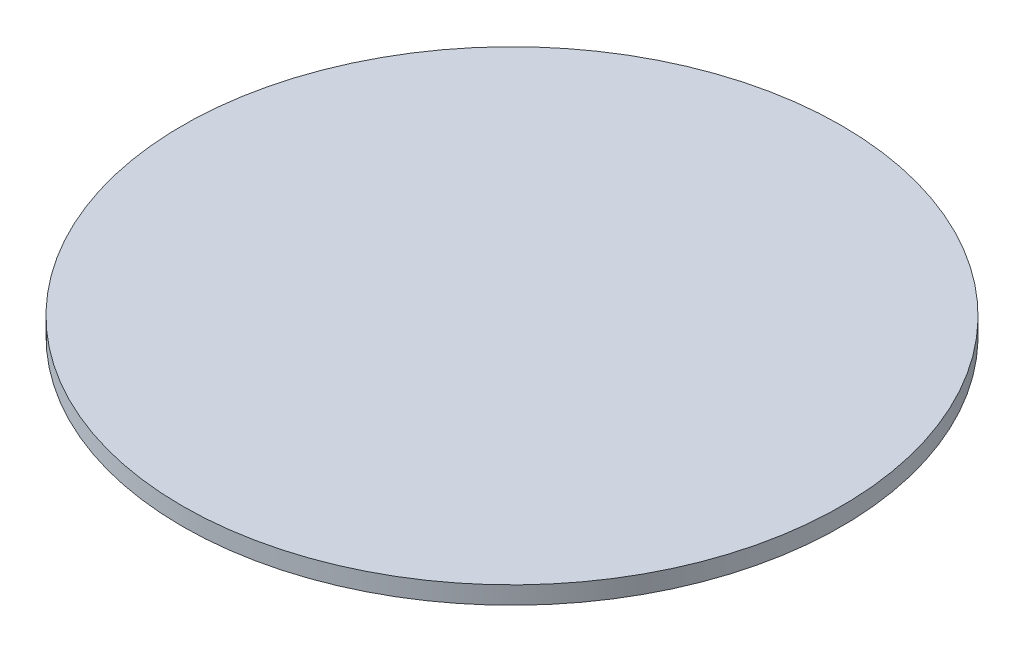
ISO-10303-21;
HEADER;
FILE_DESCRIPTION(('STEP AP214'),'2;1');
FILE_NAME('part.step','',(''),(''),'','','');
FILE_SCHEMA(('AUTOMOTIVE_DESIGN { 1 0 10303 214 1 1 1 1 }'));
ENDSEC;
DATA;
#1=APPLICATION_CONTEXT('core data for automotive mechanical design processes');
#2=APPLICATION_PROTOCOL_DEFINITION('international standard','automotive_design',2000,#1);
#3=PRODUCT_CONTEXT('',#1,'mechanical');
#4=PRODUCT('Part','Part','',(#3));
#5=PRODUCT_RELATED_PRODUCT_CATEGORY('part','',(#4));
#6=PRODUCT_DEFINITION_FORMATION('','',#4);
#7=PRODUCT_DEFINITION_CONTEXT('part definition',#1,'design');
#8=PRODUCT_DEFINITION('design','',#6,#7);
#9=PRODUCT_DEFINITION_SHAPE('','',#8);
#10=(LENGTH_UNIT() NAMED_UNIT(*) SI_UNIT(.MILLI.,.METRE.));
#11=(NAMED_UNIT(*) PLANE_ANGLE_UNIT() SI_UNIT($,.RADIAN.));
#12=(NAMED_UNIT(*) SI_UNIT($,.STERADIAN.) SOLID_ANGLE_UNIT());
#13=UNCERTAINTY_MEASURE_WITH_UNIT(LENGTH_MEASURE(1.E-05),#10,'distance_accuracy_value','');
#14=(GEOMETRIC_REPRESENTATION_CONTEXT(3) GLOBAL_UNCERTAINTY_ASSIGNED_CONTEXT((#13)) GLOBAL_UNIT_ASSIGNED_CONTEXT((#10,
#11,#12)) REPRESENTATION_CONTEXT('',''));
#15=CARTESIAN_POINT('',(0.,0.,0.));
#16=DIRECTION('',(0.,0.,1.));
#17=DIRECTION('',(1.,0.,0.));
#18=AXIS2_PLACEMENT_3D('',#15,#16,#17);
#19=CARTESIAN_POINT('',(0.,1.2,0.));
#20=DIRECTION('',(0.,-1.,0.));
#21=DIRECTION('',(0.,0.,-1.));
#22=AXIS2_PLACEMENT_3D('',#19,#20,#21);
#23=CYLINDRICAL_SURFACE('',#22,22.375);
#24=CARTESIAN_POINT('',(0.,1.2,0.));
#25=DIRECTION('',(0.,1.,0.));
#26=DIRECTION('',(0.,0.,1.));
#27=AXIS2_PLACEMENT_3D('',#24,#25,#26);
#28=CIRCLE('',#27,22.375);
#29=CARTESIAN_POINT('',(0.,1.2,22.375));
#30=VERTEX_POINT('',#29);
#31=EDGE_CURVE('E10',#30,#30,#28,.T.);
#32=ORIENTED_EDGE('',*,*,#31,.F.);
#33=EDGE_LOOP('',(#32));
#34=FACE_BOUND('',#33,.T.);
#35=CARTESIAN_POINT('',(0.,0.,0.));
#36=DIRECTION('',(0.,1.,0.));
#37=DIRECTION('',(0.,0.,1.));
#38=AXIS2_PLACEMENT_3D('',#35,#36,#37);
#39=CIRCLE('',#38,22.375);
#40=CARTESIAN_POINT('',(0.,0.,22.375));
#41=VERTEX_POINT('',#40);
#42=EDGE_CURVE('E33',#41,#41,#39,.T.);
#43=ORIENTED_EDGE('',*,*,#42,.T.);
#44=EDGE_LOOP('',(#43));
#45=FACE_BOUND('',#44,.T.);
#46=ADVANCED_FACE('F30',(#34,#45),#23,.T.);
#47=CARTESIAN_POINT('',(0.,1.2,0.));
#48=DIRECTION('',(0.,1.,0.));
#49=DIRECTION('',(0.,0.,1.));
#50=AXIS2_PLACEMENT_3D('',#47,#48,#49);
#51=PLANE('',#50);
#52=ORIENTED_EDGE('',*,*,#31,.T.);
#53=EDGE_LOOP('',(#52));
#54=FACE_BOUND('',#53,.T.);
#55=ADVANCED_FACE('F45',(#54),#51,.T.);
#56=CARTESIAN_POINT('',(0.,0.,0.));
#57=DIRECTION('',(0.,1.,0.));
#58=DIRECTION('',(0.,0.,1.));
#59=AXIS2_PLACEMENT_3D('',#56,#57,#58);
#60=PLANE('',#59);
#61=ORIENTED_EDGE('',*,*,#42,.F.);
#62=EDGE_LOOP('',(#61));
#63=FACE_BOUND('',#62,.T.);
#64=ADVANCED_FACE('F43',(#63),#60,.F.);
#65=CLOSED_SHELL('',(#46,#55,#64));
#66=MANIFOLD_SOLID_BREP('B2',#65);
#67=ADVANCED_BREP_SHAPE_REPRESENTATION('',(#18,#66),#14);
#68=SHAPE_DEFINITION_REPRESENTATION(#9,#67);
ENDSEC;
END-ISO-10303-21;
